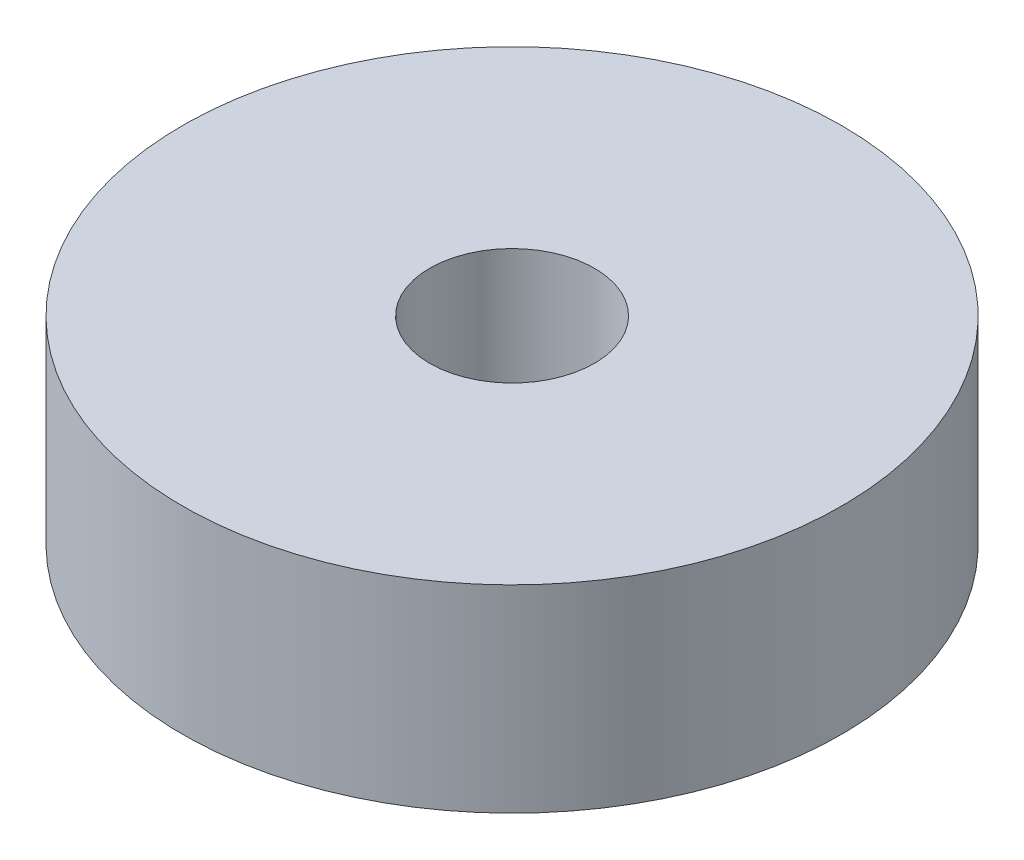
from build123d import *

# Parameters (mm, degrees)
SKETCH1_R           = 12.7
BOSS_EXTRUDE1_DEPTH = 7.62
SKETCH2_R           = 3.175
CUT_EXTRUDE1_DEPTH  = 7.62
SKETCH3_R           = 10.16
SKETCH3_R_2         = 5.715
CUT_EXTRUDE2_DEPTH  = 5.08
FILLET1_R           = 2.032


with BuildPart() as part:
    # Sketch1 → Boss-Extrude1 (new body)
    with BuildSketch(Plane(origin=(0, 0, 0), x_dir=(1, 0, 0), z_dir=(0, 1, 0))):
        with Locations(Location((0, 0, 0), (0, 0, 90))):
            Circle(SKETCH1_R)
    extrude(amount=BOSS_EXTRUDE1_DEPTH)

    # Sketch2 → Cut-Extrude1 (cut)
    with BuildSketch(Plane(origin=(0, 7.62, 0), x_dir=(1, 0, 0), z_dir=(0, 1, 0))):
        with Locations(Location((0, 0, 0), (0, 0, 270))):
            Circle(SKETCH2_R)
    extrude(amount=-CUT_EXTRUDE1_DEPTH, mode=Mode.SUBTRACT)

    # Sketch3 → Cut-Extrude2 (cut)
    with BuildSketch(Plane.XZ):
        with Locations(Location((0, 0, 0), (0, 0, 270))):
            Circle(SKETCH3_R)
        with Locations(Location((0, 0, 0), (0, 0, 270))):
            Circle(SKETCH3_R_2, mode=Mode.SUBTRACT)
    extrude(amount=-CUT_EXTRUDE2_DEPTH, mode=Mode.SUBTRACT)

    # Fillet1
    fillet1_edges = [part.edges().sort_by_distance(p)[0] for p in [
        (0, 5.08, 10.16),
        (0, 5.08, 5.715),
    ]]
    fillet(fillet1_edges, radius=FILLET1_R)


solid = part.part
